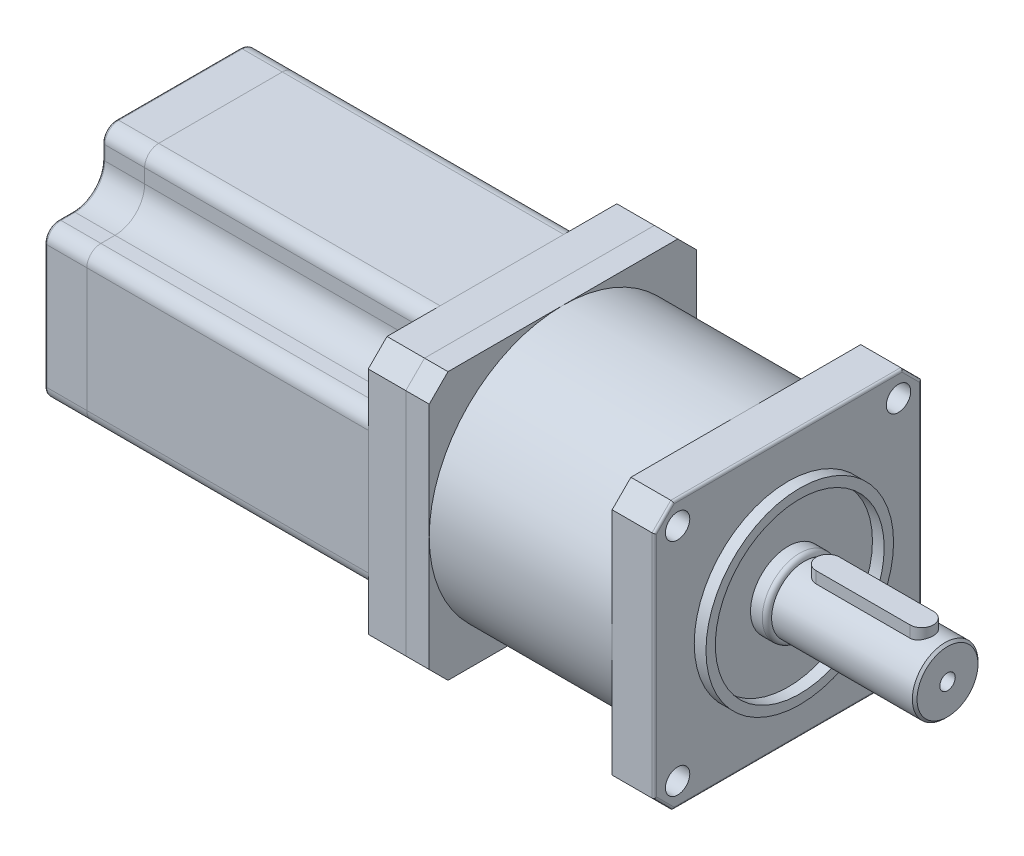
from build123d import *

# Parameters (mm, degrees)
EXTRUDE_1_DEPTH     = 9
SKETCH_2_R          = 28.5
EXTRUDE_2_DEPTH     = 39
EXTRUDE_3_DEPTH     = 5
EXTRUDE_4_DEPTH     = 8
EXTRUDE_5_DEPTH     = 60
EXTRUDE_6_DEPTH     = 9
CUT_EXTRUDE_1_DEPTH = 69
FILLET_1_R          = 0.5
FILLET_2_R          = 0.5
SKETCH_8_R          = 2.6
CUT_EXTRUDE_2_DEPTH = 9
SKETCH_9_R          = 20
SKETCH_9_R_2        = 18
EXTRUDE_7_DEPTH     = 2.5
SKETCH_10_R         = 8
EXTRUDE_8_DEPTH     = 3.5
FILLET_3_R          = 1
SKETCH_11_R         = 7
EXTRUDE_9_DEPTH     = 30.5
CUT_EXTRUDE_3_DEPTH = 3
EXTRUDE_10_DEPTH    = 5
CHAMFER_1_SIZE      = 0.5


with BuildPart() as part:
    # Sketch 1 → Extrude 1 (new body)
    with BuildSketch(Plane(origin=(0, 0, 0), x_dir=(0, 0, -1), z_dir=(1, 0, 0))):
        Polygon((-28.5, 24.5), (-24.5, 28.5), (24.5, 28.5), (28.5, 24.5), (28.5, -24.5), (24.5, -28.5), (-24.5, -28.5), (-28.5, -24.5), align=None)
    extrude(amount=-EXTRUDE_1_DEPTH)

    # Sketch 2 → Extrude 2 (add)
    with BuildSketch(Plane.ZY.offset(9)):
        Circle(SKETCH_2_R)
    extrude(amount=EXTRUDE_2_DEPTH)

    # Sketch 3 → Extrude 3 (add)
    with BuildSketch(Plane.ZY.offset(48)):
        Polygon((-24.5, -28.5), (24.5, -28.5), (28.5, -24.5), (28.5, 24.5), (24.5, 28.5), (-24.5, 28.5), (-28.5, 24.5), (-28.5, -24.5), align=None)
    extrude(amount=EXTRUDE_3_DEPTH)

    # Fillet 2
    fillet_2_edges = [part.edges().sort_by_distance(p)[0] for p in [
        (0, 26.5, 26.5),
        (0, 28.5, 0),
        (0, 26.5, -26.5),
        (0, 0, -28.5),
        (0, -26.5, -26.5),
        (0, -28.5, 0),
        (0, -26.5, 26.5),
        (0, 0, 28.5),
    ]]
    fillet(fillet_2_edges, radius=FILLET_2_R)

    # Sketch 8 → Cut-Extrude 2 (cut)
    with BuildSketch(Plane(origin=(0, 0, 0), x_dir=(0, 0, -1), z_dir=(1, 0, 0))):
        with Locations((-23.55, 23.55)):
            Circle(SKETCH_8_R)
        with Locations((23.55, 23.55)):
            Circle(SKETCH_8_R)
        with Locations((23.55, -23.55)):
            Circle(SKETCH_8_R)
        with Locations((-23.55, -23.55)):
            Circle(SKETCH_8_R)
    extrude(amount=-CUT_EXTRUDE_2_DEPTH, mode=Mode.SUBTRACT)

    # Sketch 9 → Extrude 7 (add)
    with BuildSketch(Plane(origin=(0, 0, 0), x_dir=(0, 0, -1), z_dir=(1, 0, 0))):
        Circle(SKETCH_9_R)
        Circle(SKETCH_9_R_2, mode=Mode.SUBTRACT)
    extrude(amount=EXTRUDE_7_DEPTH)

    # Sketch 10 → Extrude 8 (add)
    with BuildSketch(Plane(origin=(0, 0, 0), x_dir=(0, 0, -1), z_dir=(1, 0, 0))):
        Circle(SKETCH_10_R)
    extrude(amount=EXTRUDE_8_DEPTH)

    # Fillet 3
    fillet_3_edges = [part.edges().sort_by_distance(p)[0] for p in [
        (3.5, 0, 8),
    ]]
    fillet(fillet_3_edges, radius=FILLET_3_R)


with BuildPart() as body_2:
    # Sketch 4 → Extrude 4 (new body)
    with BuildSketch(Plane.ZY.offset(53)):
        Polygon((-24.5, -28.5), (24.5, -28.5), (28.5, -24.5), (28.5, 24.5), (24.5, 28.5), (-24.5, 28.5), (-28.5, 24.5), (-28.5, -24.5), align=None)
    extrude(amount=EXTRUDE_4_DEPTH)


with BuildPart() as body_3:
    # Sketch 5 → Extrude 5 (new body)
    with BuildSketch(Plane.ZY.offset(61)):
        Polygon((-24.5, -28.5), (24.5, -28.5), (28.5, -24.5), (28.5, 24.5), (24.5, 28.5), (-24.5, 28.5), (-28.5, 24.5), (-28.5, -24.5), align=None)
    extrude(amount=EXTRUDE_5_DEPTH)


with BuildPart() as body_4:
    # Sketch 6 → Extrude 6 (new body)
    with BuildSketch(Plane.ZY.offset(121)):
        Polygon((-24.5, -28.5), (24.5, -28.5), (28.5, -24.5), (28.5, 24.5), (24.5, 28.5), (-24.5, 28.5), (-28.5, 24.5), (-28.5, -24.5), align=None)
    extrude(amount=EXTRUDE_6_DEPTH)


with BuildPart() as cut_extrude_1_tool:
    # Sketch 7 → Cut-Extrude 1 (new body)
    with BuildSketch(Plane.ZY.offset(130)):
        with BuildLine():
            Line((-22.5, 16.17544468), (-25.5, 16.17544468))
            ThreePointArc((-25.5, 16.17544468), (-27.621320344, 15.296765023), (-28.5, 13.17544468))
            Line((-28.5, 13.17544468), (-28.5, 24.5))
            Line((-28.5, 24.5), (-24.5, 28.5))
            Line((-24.5, 28.5), (-13.17544468, 28.5))
            ThreePointArc((-13.17544468, 28.5), (-15.296765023, 27.621320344), (-16.17544468, 25.5))
            Line((-16.17544468, 25.5), (-16.17544468, 22.5))
            ThreePointArc((-16.17544468, 22.5), (-18.027864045, 18.027864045), (-22.5, 16.17544468))
        make_face()
        with BuildLine():
            Line((13.17544468, 28.5), (24.5, 28.5))
            Line((24.5, 28.5), (28.5, 24.5))
            Line((28.5, 24.5), (28.5, 13.17544468))
            ThreePointArc((28.5, 13.17544468), (27.621320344, 15.296765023), (25.5, 16.17544468))
            Line((25.5, 16.17544468), (22.5, 16.17544468))
            ThreePointArc((22.5, 16.17544468), (18.027864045, 18.027864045), (16.17544468, 22.5))
            Line((16.17544468, 22.5), (16.17544468, 25.5))
            ThreePointArc((16.17544468, 25.5), (15.296765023, 27.621320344), (13.17544468, 28.5))
        make_face()
        with BuildLine():
            Line((-25.5, -16.17544468), (-22.5, -16.17544468))
            ThreePointArc((-22.5, -16.17544468), (-18.027864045, -18.027864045), (-16.17544468, -22.5))
            Line((-16.17544468, -22.5), (-16.17544468, -25.5))
            ThreePointArc((-16.17544468, -25.5), (-15.296765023, -27.621320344), (-13.17544468, -28.5))
            Line((-13.17544468, -28.5), (-24.5, -28.5))
            Line((-24.5, -28.5), (-28.5, -24.5))
            Line((-28.5, -24.5), (-28.5, -13.17544468))
            ThreePointArc((-28.5, -13.17544468), (-27.621320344, -15.296765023), (-25.5, -16.17544468))
        make_face()
        with BuildLine():
            Line((28.5, -13.17544468), (28.5, -24.5))
            Line((28.5, -24.5), (24.5, -28.5))
            Line((24.5, -28.5), (13.17544468, -28.5))
            ThreePointArc((13.17544468, -28.5), (15.296765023, -27.621320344), (16.17544468, -25.5))
            Line((16.17544468, -25.5), (16.17544468, -22.5))
            ThreePointArc((16.17544468, -22.5), (18.027864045, -18.027864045), (22.5, -16.17544468))
            Line((22.5, -16.17544468), (25.5, -16.17544468))
            ThreePointArc((25.5, -16.17544468), (27.621320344, -15.296765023), (28.5, -13.17544468))
        make_face()
    extrude(amount=-CUT_EXTRUDE_1_DEPTH)


with BuildPart() as body_3_1:
    add(body_3.part)

    # Cut-Extrude 1: cut by cut_extrude_1_tool
    add(cut_extrude_1_tool.part, mode=Mode.SUBTRACT)


with BuildPart() as body_4_1:
    add(body_4.part)

    # Cut-Extrude 1: cut by cut_extrude_1_tool
    add(cut_extrude_1_tool.part, mode=Mode.SUBTRACT)

    # Fillet 1
    fillet_1_edges = [body_4_1.edges().sort_by_distance(p)[0] for p in [
        (-130, 18.027864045, 18.027864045),
        (-130, 16.17544468, 24),
        (-130, 15.296765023, 27.621320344),
        (-130, 27.621320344, 15.296765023),
        (-130, 24, 16.17544468),
        (-130, 0, -28.5),
        (-130, -28.5, 0),
        (-130, 0, 28.5),
        (-130, 28.5, 0),
        (-130, 27.621320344, -15.296765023),
        (-130, 15.296765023, -27.621320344),
        (-130, 16.17544468, -24),
        (-130, 18.027864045, -18.027864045),
        (-130, 24, -16.17544468),
        (-130, -18.027864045, -18.027864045),
        (-130, -16.17544468, -24),
        (-130, -15.296765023, -27.621320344),
        (-130, -27.621320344, -15.296765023),
        (-130, -24, -16.17544468),
        (-130, -18.027864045, 18.027864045),
        (-130, -24, 16.17544468),
        (-130, -27.621320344, 15.296765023),
        (-130, -15.296765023, 27.621320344),
        (-130, -16.17544468, 24),
    ]]
    fillet(fillet_1_edges, radius=FILLET_1_R)


with BuildPart() as body_5:
    # Sketch 11 → Extrude 9 (new body)
    with BuildSketch(Plane(origin=(3.5, 0, 0), x_dir=(0, 0, -1), z_dir=(1, 0, 0))):
        with Locations(Location((0, 0, 0), (0, 0, 180))):
            Circle(SKETCH_11_R)
    extrude(amount=EXTRUDE_9_DEPTH)

    # Sketch 12 → Cut-Extrude 3 (cut)
    with BuildSketch(Plane(origin=(0, 7, 0), x_dir=(1, 0, 0), z_dir=(0, 1, 0))):
        with BuildLine():
            Line((8.5, 2.5), (28.5, 2.5))
            ThreePointArc((28.5, 2.5), (31, 0), (28.5, -2.5))
            Line((28.5, -2.5), (8.5, -2.5))
            ThreePointArc((8.5, -2.5), (6, 0), (8.5, 2.5))
        make_face()
    extrude(amount=-CUT_EXTRUDE_3_DEPTH, mode=Mode.SUBTRACT)

    # Chamfer 1
    chamfer_1_edges = [body_5.edges().sort_by_distance(p)[0] for p in [
        (34, 0, -7),
    ]]
    chamfer(chamfer_1_edges, length=CHAMFER_1_SIZE)

    # Sketch 16 → Hole Wizard M4 _1 (revolve, cut)
    with BuildSketch(Plane(origin=(34, 0, 0), x_dir=(0, 0, -1), z_dir=(0, 1, 0))):
        Polygon((0, 0), (0, 10.491420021), (1.65, 9.5), (1.65, 0), align=None)
    revolve(axis=Axis((40.35, 0, 0), (-1, 0, 0)), mode=Mode.SUBTRACT)


with BuildPart() as body_6:
    # Sketch 13 → Extrude 10 (new body)
    with BuildSketch(Plane(origin=(0, 4, 0), x_dir=(1, 0, 0), z_dir=(0, 1, 0))):
        with BuildLine():
            Line((28.5, 2.5), (8.5, 2.5))
            ThreePointArc((8.5, 2.5), (6, 0), (8.5, -2.5))
            Line((8.5, -2.5), (28.5, -2.5))
            ThreePointArc((28.5, -2.5), (31, 0), (28.5, 2.5))
        make_face()
    extrude(amount=EXTRUDE_10_DEPTH)


solid = Compound([part.part, body_2.part, body_3_1.part, body_4_1.part, body_5.part, body_6.part])
